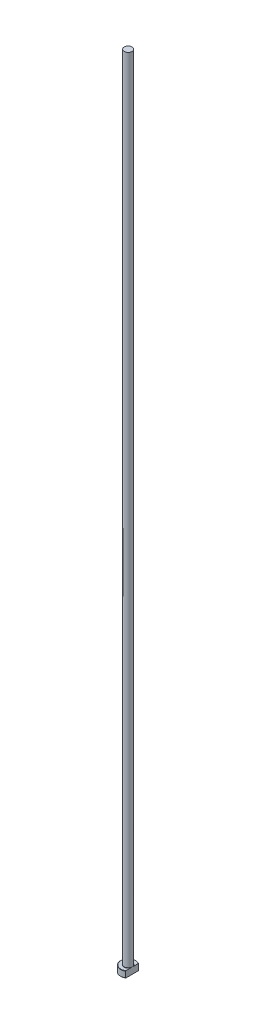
from build123d import *
from build123d.topology import SkipClean

# Parameters (mm, degrees)
CHAMFER1_SIZE = 0.2
FILLET1_R     = 0.2
KEY_DEPTH     = 631.057140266


with BuildPart() as part:
    # Sketch1 → Revolve1 (revolve)
    with BuildSketch(Plane.XY, mode=Mode.PRIVATE) as revolve1_sk:
        Polygon((0, 0), (-6, 0), (-6, 5), (-3.1, 5), (-3.1, 630), (0, 630), align=None)
    revolve(revolve1_sk.sketch.rotate(Axis((0, 259.958771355, 0), (0, -1, 0)), 270), axis=Axis((0, 259.958771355, 0), (0, -1, 0)))

    # Chamfer1
    chamfer1_edges = [part.edges().sort_by_distance(p)[0] for p in [
        (0, 5, -6),
        (0, 0, -6),
    ]]
    chamfer(chamfer1_edges, length=CHAMFER1_SIZE)

    # Fillet1
    fillet1_edges = [part.edges().sort_by_distance(p)[0] for p in [
        (0, 5, -3.1),
    ]]
    fillet(fillet1_edges, radius=FILLET1_R)

    # Sketch2 → KEY (cut, through all)
    with SkipClean():  # the faces are left unmerged after this step: merging them gives an invalid solid
        with BuildSketch(Plane(origin=(0, 0, 0), x_dir=(1, 0, 0), z_dir=(0, 1, 0))):
            with BuildLine():
                Line((3.1, 5.137119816), (3.1, -5.137119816))
                ThreePointArc((3.1, -5.137119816), (6, 0), (3.1, 5.137119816))
            make_face()
        extrude(amount=KEY_DEPTH, mode=Mode.SUBTRACT)


solid = part.part
